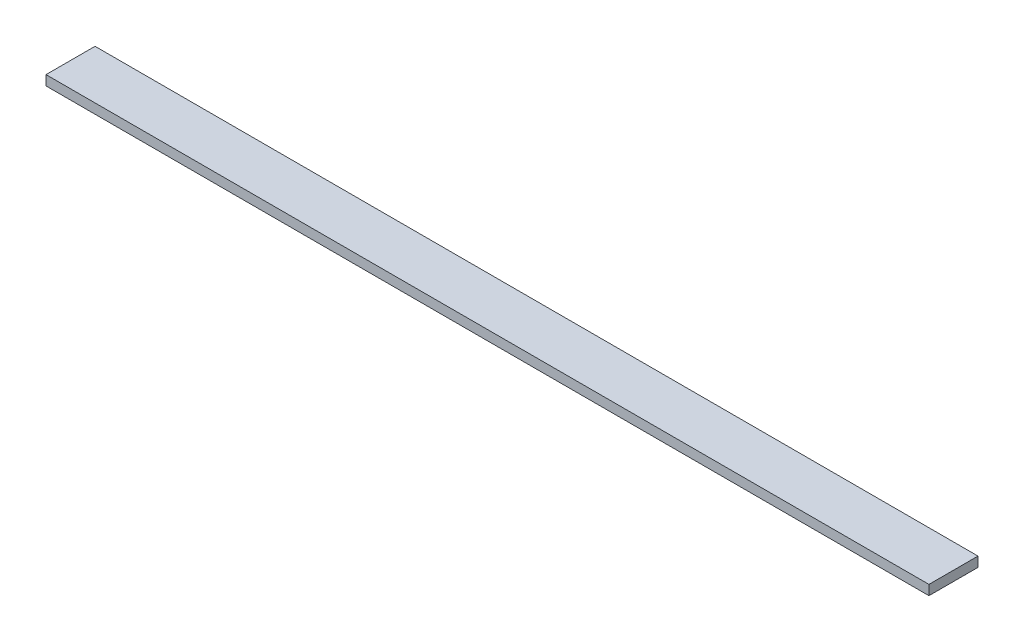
from build123d import *

# Parameters (mm, degrees)
SCHIZZO1_W                   = 10
SCHIZZO1_H                   = 2
ESTRUSIONE_ESTRUSIONE1_DEPTH = 180


with BuildPart() as part:
    # Schizzo1 → Estrusione-Estrusione1 (new body)
    with BuildSketch(Plane(origin=(0, 0, 0), x_dir=(0, 0, -1), z_dir=(1, 0, 0))):
        Rectangle(SCHIZZO1_W, SCHIZZO1_H)
    extrude(amount=ESTRUSIONE_ESTRUSIONE1_DEPTH)


solid = part.part
